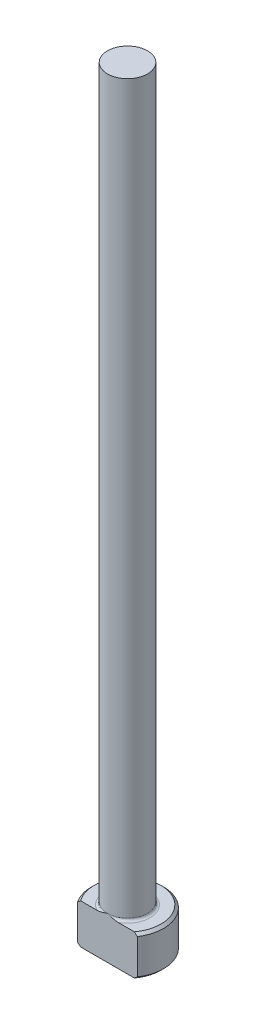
ISO-10303-21;
HEADER;
FILE_DESCRIPTION(('STEP AP214'),'2;1');
FILE_NAME('part.step','',(''),(''),'','','');
FILE_SCHEMA(('AUTOMOTIVE_DESIGN { 1 0 10303 214 1 1 1 1 }'));
ENDSEC;
DATA;
#1=APPLICATION_CONTEXT('core data for automotive mechanical design processes');
#2=APPLICATION_PROTOCOL_DEFINITION('international standard','automotive_design',2000,#1);
#3=PRODUCT_CONTEXT('',#1,'mechanical');
#4=PRODUCT('Part','Part','',(#3));
#5=PRODUCT_RELATED_PRODUCT_CATEGORY('part','',(#4));
#6=PRODUCT_DEFINITION_FORMATION('','',#4);
#7=PRODUCT_DEFINITION_CONTEXT('part definition',#1,'design');
#8=PRODUCT_DEFINITION('design','',#6,#7);
#9=PRODUCT_DEFINITION_SHAPE('','',#8);
#10=(LENGTH_UNIT() NAMED_UNIT(*) SI_UNIT(.MILLI.,.METRE.));
#11=(NAMED_UNIT(*) PLANE_ANGLE_UNIT() SI_UNIT($,.RADIAN.));
#12=(NAMED_UNIT(*) SI_UNIT($,.STERADIAN.) SOLID_ANGLE_UNIT());
#13=UNCERTAINTY_MEASURE_WITH_UNIT(LENGTH_MEASURE(1.E-05),#10,'distance_accuracy_value','');
#14=(GEOMETRIC_REPRESENTATION_CONTEXT(3) GLOBAL_UNCERTAINTY_ASSIGNED_CONTEXT((#13)) GLOBAL_UNIT_ASSIGNED_CONTEXT((#10,
#11,#12)) REPRESENTATION_CONTEXT('',''));
#15=CARTESIAN_POINT('',(0.,0.,0.));
#16=DIRECTION('',(0.,0.,1.));
#17=DIRECTION('',(1.,0.,0.));
#18=AXIS2_PLACEMENT_3D('',#15,#16,#17);
#19=CARTESIAN_POINT('',(0.,0.,0.));
#20=DIRECTION('',(0.,-1.,0.));
#21=DIRECTION('',(0.,0.,-1.));
#22=AXIS2_PLACEMENT_3D('',#19,#20,#21);
#23=PLANE('',#22);
#24=CARTESIAN_POINT('',(0.,0.,0.));
#25=DIRECTION('',(0.,-1.,0.));
#26=DIRECTION('',(0.,0.,-1.));
#27=AXIS2_PLACEMENT_3D('',#24,#25,#26);
#28=CIRCLE('',#27,3.3147);
#29=CARTESIAN_POINT('',(-2.65556240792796,0.,1.98373999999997));
#30=VERTEX_POINT('',#29);
#31=CARTESIAN_POINT('',(2.65556240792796,0.,1.98373999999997));
#32=VERTEX_POINT('',#31);
#33=EDGE_CURVE('E98',#30,#32,#28,.T.);
#34=ORIENTED_EDGE('',*,*,#33,.T.);
#35=DIRECTION('',(-1.,0.,0.));
#36=VECTOR('',#35,1.);
#37=CARTESIAN_POINT('',(-2.96654602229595,0.,1.98373999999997));
#38=LINE('',#37,#36);
#39=EDGE_CURVE('E83',#32,#30,#38,.T.);
#40=ORIENTED_EDGE('',*,*,#39,.T.);
#41=EDGE_LOOP('',(#34,#40));
#42=FACE_BOUND('',#41,.T.);
#43=ADVANCED_FACE('F32',(#42),#23,.T.);
#44=CARTESIAN_POINT('',(0.,259.958771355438,0.));
#45=DIRECTION('',(0.,1.,0.));
#46=DIRECTION('',(0.,0.,1.));
#47=AXIS2_PLACEMENT_3D('',#44,#45,#46);
#48=CYLINDRICAL_SURFACE('',#47,3.56869999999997);
#49=CARTESIAN_POINT('',(0.,3.7084,0.));
#50=DIRECTION('',(0.,1.,0.));
#51=DIRECTION('',(0.,0.,1.));
#52=AXIS2_PLACEMENT_3D('',#49,#50,#51);
#53=CIRCLE('',#52,3.56869999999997);
#54=CARTESIAN_POINT('',(-2.96654602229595,3.7084,1.98373999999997));
#55=VERTEX_POINT('',#54);
#56=CARTESIAN_POINT('',(2.96654602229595,3.7084,1.98373999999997));
#57=VERTEX_POINT('',#56);
#58=EDGE_CURVE('E104',#55,#57,#53,.F.);
#59=ORIENTED_EDGE('',*,*,#58,.T.);
#60=DIRECTION('',(0.,-1.,0.));
#61=VECTOR('',#60,1.);
#62=CARTESIAN_POINT('',(2.96654602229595,76.2,1.98373999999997));
#63=LINE('',#62,#61);
#64=CARTESIAN_POINT('',(2.96654602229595,0.253999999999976,1.98373999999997));
#65=VERTEX_POINT('',#64);
#66=EDGE_CURVE('E183',#57,#65,#63,.T.);
#67=ORIENTED_EDGE('',*,*,#66,.T.);
#68=CARTESIAN_POINT('',(0.,0.253999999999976,0.));
#69=DIRECTION('',(0.,-1.,0.));
#70=DIRECTION('',(0.,0.,-1.));
#71=AXIS2_PLACEMENT_3D('',#68,#69,#70);
#72=CIRCLE('',#71,3.56869999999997);
#73=CARTESIAN_POINT('',(-2.96654602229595,0.253999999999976,1.98373999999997));
#74=VERTEX_POINT('',#73);
#75=EDGE_CURVE('E100',#65,#74,#72,.F.);
#76=ORIENTED_EDGE('',*,*,#75,.T.);
#77=DIRECTION('',(0.,-1.,0.));
#78=VECTOR('',#77,1.);
#79=CARTESIAN_POINT('',(-2.96654602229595,76.2,1.98373999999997));
#80=LINE('',#79,#78);
#81=EDGE_CURVE('E93',#55,#74,#80,.T.);
#82=ORIENTED_EDGE('',*,*,#81,.F.);
#83=EDGE_LOOP('',(#59,#67,#76,#82));
#84=FACE_BOUND('',#83,.T.);
#85=ADVANCED_FACE('F158',(#84),#48,.T.);
#86=CARTESIAN_POINT('',(-3.56869999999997,3.9624,0.));
#87=DIRECTION('',(0.,1.,0.));
#88=DIRECTION('',(0.,0.,1.));
#89=AXIS2_PLACEMENT_3D('',#86,#87,#88);
#90=PLANE('',#89);
#91=CARTESIAN_POINT('',(0.,3.9624,0.));
#92=DIRECTION('',(0.,1.,0.));
#93=DIRECTION('',(0.,0.,1.));
#94=AXIS2_PLACEMENT_3D('',#91,#92,#93);
#95=CIRCLE('',#94,3.31469999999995);
#96=CARTESIAN_POINT('',(2.6555624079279,3.9624,1.98373999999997));
#97=VERTEX_POINT('',#96);
#98=CARTESIAN_POINT('',(-2.6555624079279,3.9624,1.98373999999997));
#99=VERTEX_POINT('',#98);
#100=EDGE_CURVE('E178',#97,#99,#95,.T.);
#101=ORIENTED_EDGE('',*,*,#100,.T.);
#102=DIRECTION('',(1.,0.,0.));
#103=VECTOR('',#102,1.);
#104=CARTESIAN_POINT('',(-3.56869999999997,3.9624,1.98373999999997));
#105=LINE('',#104,#103);
#106=CARTESIAN_POINT('',(-1.03549790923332,3.96240000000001,1.98373999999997));
#107=VERTEX_POINT('',#106);
#108=EDGE_CURVE('E57',#99,#107,#105,.T.);
#109=ORIENTED_EDGE('',*,*,#108,.T.);
#110=CARTESIAN_POINT('',(0.,3.9624,0.));
#111=DIRECTION('',(0.,1.,0.));
#112=DIRECTION('',(0.,0.,1.));
#113=AXIS2_PLACEMENT_3D('',#110,#111,#112);
#114=CIRCLE('',#113,2.23773999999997);
#115=CARTESIAN_POINT('',(1.03549790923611,3.96240000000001,1.98373999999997));
#116=VERTEX_POINT('',#115);
#117=EDGE_CURVE('E107',#107,#116,#114,.F.);
#118=ORIENTED_EDGE('',*,*,#117,.T.);
#119=EDGE_CURVE('E136',#116,#97,#105,.T.);
#120=ORIENTED_EDGE('',*,*,#119,.T.);
#121=EDGE_LOOP('',(#101,#109,#118,#120));
#122=FACE_BOUND('',#121,.T.);
#123=ADVANCED_FACE('F147',(#122),#90,.T.);
#124=CARTESIAN_POINT('',(0.,3.96239999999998,0.));
#125=DIRECTION('',(0.,-1.,0.));
#126=DIRECTION('',(0.,0.,-1.));
#127=AXIS2_PLACEMENT_3D('',#124,#125,#126);
#128=CONICAL_SURFACE('',#127,3.31469999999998,0.78539816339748);
#129=ORIENTED_EDGE('',*,*,#58,.F.);
#130=CARTESIAN_POINT('',(-6.52986193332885,0.452561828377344,1.98373999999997));
#131=CARTESIAN_POINT('',(-6.40873458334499,0.568456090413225,1.98373999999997));
#132=CARTESIAN_POINT('',(-6.28747416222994,0.684211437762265,1.98373999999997));
#133=CARTESIAN_POINT('',(-6.04463163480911,0.915385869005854,1.98373999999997));
#134=CARTESIAN_POINT('',(-5.92304952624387,1.03080495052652,1.98373999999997));
#135=CARTESIAN_POINT('',(-5.55767819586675,1.37652609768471,1.98373999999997));
#136=CARTESIAN_POINT('',(-5.3133253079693,1.60623326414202,1.98373999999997));
#137=CARTESIAN_POINT('',(-4.82149182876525,2.06424424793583,1.98373999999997));
#138=CARTESIAN_POINT('',(-4.57400269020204,2.29253892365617,1.98373999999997));
#139=CARTESIAN_POINT('',(-4.20028152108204,2.63221766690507,1.98373999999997));
#140=CARTESIAN_POINT('',(-4.07530040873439,2.74497702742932,1.98373999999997));
#141=CARTESIAN_POINT('',(-3.82427385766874,2.96930379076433,1.98373999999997));
#142=CARTESIAN_POINT('',(-3.69822843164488,3.08087120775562,1.98373999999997));
#143=CARTESIAN_POINT('',(-3.4400142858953,3.30660356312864,1.98373999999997));
#144=CARTESIAN_POINT('',(-3.30779329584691,3.42070884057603,1.98373999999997));
#145=CARTESIAN_POINT('',(-3.04138139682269,3.64664156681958,1.98373999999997));
#146=CARTESIAN_POINT('',(-2.90719023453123,3.75846871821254,1.98373999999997));
#147=CARTESIAN_POINT('',(-2.6361583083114,3.9788690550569,1.98373999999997));
#148=CARTESIAN_POINT('',(-2.49931761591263,4.08744232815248,1.98373999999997));
#149=CARTESIAN_POINT('',(-2.22197102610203,4.2997921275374,1.98373999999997));
#150=CARTESIAN_POINT('',(-2.08146612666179,4.40356993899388,1.98373999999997));
#151=CARTESIAN_POINT('',(-1.85886698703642,4.55911967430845,1.98373999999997));
#152=CARTESIAN_POINT('',(-1.77859431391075,4.61348917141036,1.98373999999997));
#153=CARTESIAN_POINT('',(-1.61606314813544,4.71915963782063,1.98373999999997));
#154=CARTESIAN_POINT('',(-1.53380502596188,4.77046117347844,1.98373999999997));
#155=CARTESIAN_POINT('',(-1.36686413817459,4.86898764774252,1.98373999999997));
#156=CARTESIAN_POINT('',(-1.28218169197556,4.91621312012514,1.98373999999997));
#157=CARTESIAN_POINT('',(-1.10999775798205,5.00512382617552,1.98373999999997));
#158=CARTESIAN_POINT('',(-1.02249748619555,5.0468114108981,1.98373999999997));
#159=CARTESIAN_POINT('',(-0.81383013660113,5.13563123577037,1.98373999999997));
#160=CARTESIAN_POINT('',(-0.691323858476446,5.17980224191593,1.98373999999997));
#161=CARTESIAN_POINT('',(-0.503703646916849,5.23128984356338,1.98373999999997));
#162=CARTESIAN_POINT('',(-0.440603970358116,5.24598141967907,1.98373999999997));
#163=CARTESIAN_POINT('',(-0.313367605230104,5.26973239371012,1.98373999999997));
#164=CARTESIAN_POINT('',(-0.249231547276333,5.27879509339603,1.98373999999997));
#165=CARTESIAN_POINT('',(-0.119629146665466,5.29081518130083,1.98373999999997));
#166=CARTESIAN_POINT('',(-0.0541560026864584,5.29370053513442,1.98373999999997));
#167=CARTESIAN_POINT('',(0.0767508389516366,5.29295512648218,1.98373999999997));
#168=CARTESIAN_POINT('',(0.142184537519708,5.28932452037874,1.98373999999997));
#169=CARTESIAN_POINT('',(0.27249490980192,5.27578328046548,1.98373999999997));
#170=CARTESIAN_POINT('',(0.337370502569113,5.26586242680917,1.98373999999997));
#171=CARTESIAN_POINT('',(0.465987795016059,5.24034027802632,1.98373999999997));
#172=CARTESIAN_POINT('',(0.529729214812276,5.22473760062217,1.98373999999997));
#173=CARTESIAN_POINT('',(0.683350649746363,5.18075634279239,1.98373999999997));
#174=CARTESIAN_POINT('',(0.772481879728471,5.14977428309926,1.98373999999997));
#175=CARTESIAN_POINT('',(0.947660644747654,5.08010058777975,1.98373999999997));
#176=CARTESIAN_POINT('',(1.03370599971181,5.04140362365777,1.98373999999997));
#177=CARTESIAN_POINT('',(1.20339709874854,4.95807051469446,1.98373999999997));
#178=CARTESIAN_POINT('',(1.28702792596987,4.91340434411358,1.98373999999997));
#179=CARTESIAN_POINT('',(1.41060260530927,4.84319759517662,1.98373999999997));
#180=CARTESIAN_POINT('',(1.45147639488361,4.81926449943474,1.98373999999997));
#181=CARTESIAN_POINT('',(1.53266103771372,4.77046435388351,1.98373999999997));
#182=CARTESIAN_POINT('',(1.57297191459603,4.745597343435,1.98373999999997));
#183=CARTESIAN_POINT('',(1.70662848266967,4.66127979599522,1.98373999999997));
#184=CARTESIAN_POINT('',(1.79884137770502,4.60003201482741,1.98373999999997));
#185=CARTESIAN_POINT('',(1.981065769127,4.47433262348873,1.98373999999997));
#186=CARTESIAN_POINT('',(2.07107672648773,4.40988024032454,1.98373999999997));
#187=CARTESIAN_POINT('',(2.24940000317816,4.27853620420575,1.98373999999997));
#188=CARTESIAN_POINT('',(2.3377109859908,4.21164274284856,1.98373999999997));
#189=CARTESIAN_POINT('',(2.51291571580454,4.07602097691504,1.98373999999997));
#190=CARTESIAN_POINT('',(2.59980937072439,4.00729255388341,1.98373999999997));
#191=CARTESIAN_POINT('',(2.85922047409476,3.79863581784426,1.98373999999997));
#192=CARTESIAN_POINT('',(3.03001914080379,3.65657350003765,1.98373999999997));
#193=CARTESIAN_POINT('',(3.36845974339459,3.368919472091,1.98373999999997));
#194=CARTESIAN_POINT('',(3.5361030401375,3.22332934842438,1.98373999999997));
#195=CARTESIAN_POINT('',(3.86946040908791,2.92948579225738,1.98373999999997));
#196=CARTESIAN_POINT('',(4.03517138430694,2.7812288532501,1.98373999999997));
#197=CARTESIAN_POINT('',(4.36503284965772,2.48295883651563,1.98373999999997));
#198=CARTESIAN_POINT('',(4.52918317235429,2.33294557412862,1.98373999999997));
#199=CARTESIAN_POINT('',(4.85609064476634,2.03183529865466,1.98373999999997));
#200=CARTESIAN_POINT('',(5.01884932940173,1.88073994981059,1.98373999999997));
#201=CARTESIAN_POINT('',(5.34346533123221,1.57758411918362,1.98373999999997));
#202=CARTESIAN_POINT('',(5.50532264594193,1.425523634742,1.98373999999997));
#203=CARTESIAN_POINT('',(5.73906525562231,1.20490693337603,1.98373999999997));
#204=CARTESIAN_POINT('',(5.81123331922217,1.13664991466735,1.98373999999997));
#205=CARTESIAN_POINT('',(5.95545466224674,0.999988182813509,1.98373999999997));
#206=CARTESIAN_POINT('',(6.02750791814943,0.931583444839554,1.98373999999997));
#207=CARTESIAN_POINT('',(6.17134461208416,0.794799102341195,1.98373999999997));
#208=CARTESIAN_POINT('',(6.24312829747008,0.726419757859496,1.98373999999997));
#209=CARTESIAN_POINT('',(6.3865776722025,0.589563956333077,1.98373999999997));
#210=CARTESIAN_POINT('',(6.45824338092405,0.521087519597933,1.98373999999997));
#211=CARTESIAN_POINT('',(6.52986193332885,0.452561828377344,1.98373999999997));
#212=B_SPLINE_CURVE_WITH_KNOTS('',3,(#130,#131,#132,#133,#134,#135,#136,#137,#138,#139,#140,
#141,#142,#143,#144,#145,#146,#147,#148,#149,#150,#151,#152,#153,#154,#155,#156,#157,#158,#159,
#160,#161,#162,#163,#164,#165,#166,#167,#168,#169,#170,#171,#172,#173,#174,#175,#176,#177,#178,
#179,#180,#181,#182,#183,#184,#185,#186,#187,#188,#189,#190,#191,#192,#193,#194,#195,#196,#197,
#198,#199,#200,#201,#202,#203,#204,#205,#206,#207,#208,#209,#210,#211),.UNSPECIFIED.,.F.,.F.,(4,
2,2,2,2,2,2,2,2,2,2,2,2,2,2,2,2,2,2,2,2,2,2,2,2,2,2,2,2,2,2,2,2,2,2,2,2,2,2,2,4),(0.,
0.50292129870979,1.00584613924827,2.01195072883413,3.02203392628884,3.52701801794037,
4.03199609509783,4.55592627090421,5.07992441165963,5.60390842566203,6.12775118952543,
6.41855604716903,6.70930705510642,7.00001993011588,7.29060898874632,7.67991368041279,
7.87406585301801,8.06810403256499,8.26439284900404,8.4606769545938,8.65728078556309,
8.8539324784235,9.13651242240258,9.41928821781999,9.70354407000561,9.84563042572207,
9.98771079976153,10.3197055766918,10.6517808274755,10.9841072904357,11.3164552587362,
11.9828350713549,12.6489205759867,13.3159573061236,13.9830648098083,14.6493042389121,
15.3155455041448,15.6135474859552,15.9116042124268,16.2090224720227,16.5063857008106),.UNSPECIFIED.);
#213=EDGE_CURVE('E135',#55,#99,#212,.T.);
#214=ORIENTED_EDGE('',*,*,#213,.T.);
#215=ORIENTED_EDGE('',*,*,#100,.F.);
#216=EDGE_CURVE('E127',#97,#57,#212,.T.);
#217=ORIENTED_EDGE('',*,*,#216,.T.);
#218=EDGE_LOOP('',(#129,#214,#215,#217));
#219=FACE_BOUND('',#218,.T.);
#220=ADVANCED_FACE('F143',(#219),#128,.T.);
#221=CARTESIAN_POINT('',(0.,0.253999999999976,0.));
#222=DIRECTION('',(0.,1.,0.));
#223=DIRECTION('',(0.,0.,1.));
#224=AXIS2_PLACEMENT_3D('',#221,#222,#223);
#225=CONICAL_SURFACE('',#224,3.56869999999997,0.785398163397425);
#226=ORIENTED_EDGE('',*,*,#75,.F.);
#227=CARTESIAN_POINT('',(6.52986193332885,3.50983817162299,1.98373999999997));
#228=CARTESIAN_POINT('',(6.40873458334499,3.39394390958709,1.98373999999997));
#229=CARTESIAN_POINT('',(6.28747416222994,3.27818856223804,1.98373999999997));
#230=CARTESIAN_POINT('',(6.0446316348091,3.04701413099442,1.98373999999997));
#231=CARTESIAN_POINT('',(5.92304952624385,2.93159504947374,1.98373999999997));
#232=CARTESIAN_POINT('',(5.55767819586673,2.58587390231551,1.98373999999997));
#233=CARTESIAN_POINT('',(5.31332530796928,2.35616673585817,1.98373999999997));
#234=CARTESIAN_POINT('',(4.82149182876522,1.8981557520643,1.98373999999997));
#235=CARTESIAN_POINT('',(4.574002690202,1.66986107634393,1.98373999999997));
#236=CARTESIAN_POINT('',(4.200281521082,1.33018233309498,1.98373999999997));
#237=CARTESIAN_POINT('',(4.07530040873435,1.21742297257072,1.98373999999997));
#238=CARTESIAN_POINT('',(3.82427385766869,0.993096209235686,1.98373999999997));
#239=CARTESIAN_POINT('',(3.69822843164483,0.881528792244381,1.98373999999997));
#240=CARTESIAN_POINT('',(3.44001428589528,0.655796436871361,1.98373999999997));
#241=CARTESIAN_POINT('',(3.30779329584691,0.541691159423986,1.98373999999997));
#242=CARTESIAN_POINT('',(3.04138139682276,0.315758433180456,1.98373999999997));
#243=CARTESIAN_POINT('',(2.90719023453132,0.203931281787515,1.98373999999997));
#244=CARTESIAN_POINT('',(2.63615830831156,-0.0164690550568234,1.98373999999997));
#245=CARTESIAN_POINT('',(2.49931761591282,-0.125042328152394,1.98373999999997));
#246=CARTESIAN_POINT('',(2.22197102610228,-0.337392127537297,1.98373999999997));
#247=CARTESIAN_POINT('',(2.08146612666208,-0.441169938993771,1.98373999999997));
#248=CARTESIAN_POINT('',(1.85886698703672,-0.596719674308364,1.98373999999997));
#249=CARTESIAN_POINT('',(1.77859431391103,-0.651089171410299,1.98373999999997));
#250=CARTESIAN_POINT('',(1.61606314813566,-0.756759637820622,1.98373999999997));
#251=CARTESIAN_POINT('',(1.53380502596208,-0.808061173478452,1.98373999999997));
#252=CARTESIAN_POINT('',(1.36686413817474,-0.90658764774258,1.98373999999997));
#253=CARTESIAN_POINT('',(1.28218169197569,-0.953813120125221,1.98373999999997));
#254=CARTESIAN_POINT('',(1.10999775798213,-1.04272382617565,1.98373999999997));
#255=CARTESIAN_POINT('',(1.0224974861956,-1.08441141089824,1.98373999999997));
#256=CARTESIAN_POINT('',(0.813830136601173,-1.17323123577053,1.98373999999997));
#257=CARTESIAN_POINT('',(0.691323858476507,-1.2174022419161,1.98373999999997));
#258=CARTESIAN_POINT('',(0.503703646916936,-1.26888984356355,1.98373999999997));
#259=CARTESIAN_POINT('',(0.440603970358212,-1.28358141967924,1.98373999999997));
#260=CARTESIAN_POINT('',(0.313367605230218,-1.3073323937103,1.98373999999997));
#261=CARTESIAN_POINT('',(0.249231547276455,-1.31639509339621,1.98373999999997));
#262=CARTESIAN_POINT('',(0.119629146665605,-1.32841518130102,1.98373999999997));
#263=CARTESIAN_POINT('',(0.0541560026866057,-1.33130053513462,1.98373999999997));
#264=CARTESIAN_POINT('',(-0.0767508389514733,-1.33055512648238,1.98373999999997));
#265=CARTESIAN_POINT('',(-0.142184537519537,-1.32692452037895,1.98373999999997));
#266=CARTESIAN_POINT('',(-0.272494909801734,-1.3133832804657,1.98373999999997));
#267=CARTESIAN_POINT('',(-0.337370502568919,-1.30346242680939,1.98373999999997));
#268=CARTESIAN_POINT('',(-0.465987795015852,-1.27794027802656,1.98373999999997));
#269=CARTESIAN_POINT('',(-0.529729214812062,-1.26233760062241,1.98373999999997));
#270=CARTESIAN_POINT('',(-0.683350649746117,-1.21835634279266,1.98373999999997));
#271=CARTESIAN_POINT('',(-0.772481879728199,-1.18737428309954,1.98373999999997));
#272=CARTESIAN_POINT('',(-0.947660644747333,-1.11770058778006,1.98373999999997));
#273=CARTESIAN_POINT('',(-1.03370599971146,-1.0790036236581,1.98373999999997));
#274=CARTESIAN_POINT('',(-1.20339709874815,-0.99567051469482,1.98373999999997));
#275=CARTESIAN_POINT('',(-1.28702792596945,-0.951004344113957,1.98373999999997));
#276=CARTESIAN_POINT('',(-1.41060260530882,-0.88079759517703,1.98373999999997));
#277=CARTESIAN_POINT('',(-1.45147639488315,-0.856864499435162,1.98373999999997));
#278=CARTESIAN_POINT('',(-1.53266103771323,-0.808064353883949,1.98373999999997));
#279=CARTESIAN_POINT('',(-1.57297191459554,-0.783197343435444,1.98373999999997));
#280=CARTESIAN_POINT('',(-1.70662848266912,-0.698879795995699,1.98373999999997));
#281=CARTESIAN_POINT('',(-1.79884137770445,-0.637632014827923,1.98373999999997));
#282=CARTESIAN_POINT('',(-1.98106576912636,-0.511932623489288,1.98373999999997));
#283=CARTESIAN_POINT('',(-2.07107672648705,-0.447480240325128,1.98373999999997));
#284=CARTESIAN_POINT('',(-2.24940000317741,-0.316136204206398,1.98373999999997));
#285=CARTESIAN_POINT('',(-2.33771098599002,-0.249242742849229,1.98373999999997));
#286=CARTESIAN_POINT('',(-2.51291571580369,-0.113620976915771,1.98373999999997));
#287=CARTESIAN_POINT('',(-2.59980937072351,-0.0448925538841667,1.98373999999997));
#288=CARTESIAN_POINT('',(-2.85922047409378,0.163764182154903,1.98373999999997));
#289=CARTESIAN_POINT('',(-3.03001914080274,0.305826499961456,1.98373999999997));
#290=CARTESIAN_POINT('',(-3.36845974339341,0.593480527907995,1.98373999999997));
#291=CARTESIAN_POINT('',(-3.53610304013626,0.739070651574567,1.98373999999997));
#292=CARTESIAN_POINT('',(-3.86946040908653,1.03291420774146,1.98373999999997));
#293=CARTESIAN_POINT('',(-4.03517138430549,1.18117114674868,1.98373999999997));
#294=CARTESIAN_POINT('',(-4.36503284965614,1.47944116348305,1.98373999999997));
#295=CARTESIAN_POINT('',(-4.52918317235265,1.62945442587,1.98373999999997));
#296=CARTESIAN_POINT('',(-4.85609064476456,1.93056470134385,1.98373999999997));
#297=CARTESIAN_POINT('',(-5.01884932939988,2.08166005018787,1.98373999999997));
#298=CARTESIAN_POINT('',(-5.34346533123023,2.38481588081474,1.98373999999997));
#299=CARTESIAN_POINT('',(-5.50532264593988,2.5368763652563,1.98373999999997));
#300=CARTESIAN_POINT('',(-5.73906525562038,2.75749306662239,1.98373999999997));
#301=CARTESIAN_POINT('',(-5.81123331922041,2.82575008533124,1.98373999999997));
#302=CARTESIAN_POINT('',(-5.95545466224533,2.96241181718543,1.98373999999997));
#303=CARTESIAN_POINT('',(-6.02750791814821,3.03081655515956,1.98373999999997));
#304=CARTESIAN_POINT('',(-6.17134461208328,3.16760089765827,1.98373999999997));
#305=CARTESIAN_POINT('',(-6.24312829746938,3.23598024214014,1.98373999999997));
#306=CARTESIAN_POINT('',(-6.38657767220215,3.37283604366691,1.98373999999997));
#307=CARTESIAN_POINT('',(-6.45824338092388,3.44131248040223,1.98373999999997));
#308=CARTESIAN_POINT('',(-6.52986193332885,3.50983817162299,1.98373999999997));
#309=B_SPLINE_CURVE_WITH_KNOTS('',3,(#227,#228,#229,#230,#231,#232,#233,#234,#235,#236,#237,
#238,#239,#240,#241,#242,#243,#244,#245,#246,#247,#248,#249,#250,#251,#252,#253,#254,#255,#256,
#257,#258,#259,#260,#261,#262,#263,#264,#265,#266,#267,#268,#269,#270,#271,#272,#273,#274,#275,
#276,#277,#278,#279,#280,#281,#282,#283,#284,#285,#286,#287,#288,#289,#290,#291,#292,#293,#294,
#295,#296,#297,#298,#299,#300,#301,#302,#303,#304,#305,#306,#307,#308),.UNSPECIFIED.,.F.,.F.,(4,
2,2,2,2,2,2,2,2,2,2,2,2,2,2,2,2,2,2,2,2,2,2,2,2,2,2,2,2,2,2,2,2,2,2,2,2,2,2,2,4),(0.,
0.502921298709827,1.00584613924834,2.01195072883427,3.02203392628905,3.5270180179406,
4.0319960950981,4.55592627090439,5.07992441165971,5.60390842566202,6.12775118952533,
6.41855604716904,6.70930705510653,7.00001993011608,7.29060898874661,7.67991368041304,
7.87406585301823,8.06810403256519,8.26439284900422,8.46067695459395,8.65728078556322,
8.85393247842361,9.1365124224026,9.41928821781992,9.70354407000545,9.84563042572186,
9.98771079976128,10.3197055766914,10.6517808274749,10.984107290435,11.3164552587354,
11.9828350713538,12.6489205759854,13.3159573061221,13.9830648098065,14.64930423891,
15.3155455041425,15.6135474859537,15.911604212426,16.2090224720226,16.5063857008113),.UNSPECIFIED.);
#310=EDGE_CURVE('E86',#65,#32,#309,.T.);
#311=ORIENTED_EDGE('',*,*,#310,.T.);
#312=ORIENTED_EDGE('',*,*,#33,.F.);
#313=EDGE_CURVE('E89',#30,#74,#309,.T.);
#314=ORIENTED_EDGE('',*,*,#313,.T.);
#315=EDGE_LOOP('',(#226,#311,#312,#314));
#316=FACE_BOUND('',#315,.T.);
#317=ADVANCED_FACE('F97',(#316),#225,.T.);
#318=CARTESIAN_POINT('',(0.,4.21640000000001,0.));
#319=DIRECTION('',(0.,1.,0.));
#320=DIRECTION('',(0.,0.,1.));
#321=AXIS2_PLACEMENT_3D('',#318,#319,#320);
#322=TOROIDAL_SURFACE('',#321,2.23773999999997,0.254);
#323=CARTESIAN_POINT('',(0.,4.21640000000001,1.98373999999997));
#324=CARTESIAN_POINT('',(-4.02307017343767E-11,4.21640057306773,1.98373999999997));
#325=CARTESIAN_POINT('',(1.40828581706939E-07,4.21640114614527,1.98373999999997));
#326=CARTESIAN_POINT('',(5.7339269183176E-07,4.21640224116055,1.98373999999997));
#327=CARTESIAN_POINT('',(8.70731400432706E-07,4.21640276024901,1.98373999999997));
#328=CARTESIAN_POINT('',(1.58225797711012E-06,4.21640380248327,1.98373999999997));
#329=CARTESIAN_POINT('',(2.00604119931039E-06,4.21640431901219,1.98373999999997));
#330=CARTESIAN_POINT('',(2.91133999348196E-06,4.21640528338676,1.98373999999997));
#331=CARTESIAN_POINT('',(3.39207133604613E-06,4.21640573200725,1.98373999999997));
#332=CARTESIAN_POINT('',(5.14628594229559E-06,4.21640727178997,1.98373999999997));
#333=CARTESIAN_POINT('',(6.49332487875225E-06,4.21640828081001,1.98373999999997));
#334=CARTESIAN_POINT('',(9.24843947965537E-06,4.21641004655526,1.98373999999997));
#335=CARTESIAN_POINT('',(1.06506929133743E-05,4.21641081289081,1.98373999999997));
#336=CARTESIAN_POINT('',(1.62369385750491E-05,4.21641377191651,1.98373999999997));
#337=CARTESIAN_POINT('',(2.04997858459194E-05,4.2164158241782,1.98373999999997));
#338=CARTESIAN_POINT('',(2.88176617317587E-05,4.21641910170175,1.98373999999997));
#339=CARTESIAN_POINT('',(3.28481085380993E-05,4.21642039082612,1.98373999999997));
#340=CARTESIAN_POINT('',(5.03242637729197E-05,4.21642599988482,1.98373999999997));
#341=CARTESIAN_POINT('',(6.37475444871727E-05,4.21643035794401,1.98373999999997));
#342=CARTESIAN_POINT('',(8.86866389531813E-05,4.21643721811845,1.98373999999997));
#343=CARTESIAN_POINT('',(0.000100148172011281,4.21643990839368,1.98373999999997));
#344=CARTESIAN_POINT('',(0.000184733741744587,4.21646156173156,1.98373999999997));
#345=CARTESIAN_POINT('',(0.0002551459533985,4.21648964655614,1.98373999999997));
#346=CARTESIAN_POINT('',(0.000530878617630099,4.21659565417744,1.98373999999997));
#347=CARTESIAN_POINT('',(0.000738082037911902,4.21666677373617,1.98373999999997));
#348=CARTESIAN_POINT('',(0.00154925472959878,4.21694925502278,1.98373999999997));
#349=CARTESIAN_POINT('',(0.00215130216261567,4.21716774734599,1.98373999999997));
#350=CARTESIAN_POINT('',(0.00462988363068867,4.21806309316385,1.98373999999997));
#351=CARTESIAN_POINT('',(0.00650853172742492,4.21873189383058,1.98373999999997));
#352=CARTESIAN_POINT('',(0.0303581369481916,4.22722764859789,1.98373999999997));
#353=CARTESIAN_POINT('',(0.0523158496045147,4.23510626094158,1.98373999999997));
#354=CARTESIAN_POINT('',(0.0954269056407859,4.25047917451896,1.98373999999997));
#355=CARTESIAN_POINT('',(0.11657919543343,4.25797672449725,1.98373999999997));
#356=CARTESIAN_POINT('',(0.161458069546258,4.27377445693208,1.98373999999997));
#357=CARTESIAN_POINT('',(0.185188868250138,4.28206294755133,1.98373999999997));
#358=CARTESIAN_POINT('',(0.232964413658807,4.29853259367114,1.98373999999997));
#359=CARTESIAN_POINT('',(0.257009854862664,4.30671173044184,1.98373999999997));
#360=CARTESIAN_POINT('',(0.316193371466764,4.32648112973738,1.98373999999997));
#361=CARTESIAN_POINT('',(0.3513814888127,4.33792303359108,1.98373999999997));
#362=CARTESIAN_POINT('',(0.421152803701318,4.35974103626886,1.98373999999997));
#363=CARTESIAN_POINT('',(0.455729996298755,4.37013624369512,1.98373999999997));
#364=CARTESIAN_POINT('',(0.532487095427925,4.39200885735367,1.98373999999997));
#365=CARTESIAN_POINT('',(0.574734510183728,4.4032531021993,1.98373999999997));
#366=CARTESIAN_POINT('',(0.6600384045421,4.42385016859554,1.98373999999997));
#367=CARTESIAN_POINT('',(0.703098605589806,4.43318780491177,1.98373999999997));
#368=CARTESIAN_POINT('',(0.792838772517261,4.44980860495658,1.98373999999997));
#369=CARTESIAN_POINT('',(0.83955648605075,4.45689590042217,1.98373999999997));
#370=CARTESIAN_POINT('',(0.933305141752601,4.46701113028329,1.98373999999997));
#371=CARTESIAN_POINT('',(0.980334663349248,4.47005158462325,1.98373999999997));
#372=CARTESIAN_POINT('',(1.07363680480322,4.47068781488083,1.98373999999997));
#373=CARTESIAN_POINT('',(1.11990681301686,4.46838602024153,1.98373999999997));
#374=CARTESIAN_POINT('',(1.18820667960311,4.45949572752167,1.98373999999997));
#375=CARTESIAN_POINT('',(1.21059706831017,4.45568261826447,1.98373999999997));
#376=CARTESIAN_POINT('',(1.25489724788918,4.44592513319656,1.98373999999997));
#377=CARTESIAN_POINT('',(1.27680769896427,4.43998390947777,1.98373999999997));
#378=CARTESIAN_POINT('',(1.31298334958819,4.42779727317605,1.98373999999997));
#379=CARTESIAN_POINT('',(1.32747926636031,4.42223947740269,1.98373999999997));
#380=CARTESIAN_POINT('',(1.35590450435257,4.40970381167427,1.98373999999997));
#381=CARTESIAN_POINT('',(1.36983212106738,4.40272199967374,1.98373999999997));
#382=CARTESIAN_POINT('',(1.39685784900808,4.38707849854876,1.98373999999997));
#383=CARTESIAN_POINT('',(1.40994935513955,4.37840521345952,1.98373999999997));
#384=CARTESIAN_POINT('',(1.43467906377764,4.35918713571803,1.98373999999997));
#385=CARTESIAN_POINT('',(1.44632058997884,4.34864676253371,1.98373999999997));
#386=CARTESIAN_POINT('',(1.46405523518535,4.32920735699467,1.98373999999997));
#387=CARTESIAN_POINT('',(1.47073699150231,4.32084820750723,1.98373999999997));
#388=CARTESIAN_POINT('',(1.48274781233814,4.30319678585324,1.98373999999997));
#389=CARTESIAN_POINT('',(1.48807744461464,4.29390490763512,1.98373999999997));
#390=CARTESIAN_POINT('',(1.49706189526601,4.27440249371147,1.98373999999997));
#391=CARTESIAN_POINT('',(1.50069745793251,4.2641829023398,1.98373999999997));
#392=CARTESIAN_POINT('',(1.50584635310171,4.24322268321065,1.98373999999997));
#393=CARTESIAN_POINT('',(1.50736266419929,4.23248280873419,1.98373999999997));
#394=CARTESIAN_POINT('',(1.50805409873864,4.21251978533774,1.98373999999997));
#395=CARTESIAN_POINT('',(1.50754134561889,4.2033063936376,1.98373999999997));
#396=CARTESIAN_POINT('',(1.50490308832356,4.18511471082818,1.98373999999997));
#397=CARTESIAN_POINT('',(1.50277735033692,4.17613645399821,1.98373999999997));
#398=CARTESIAN_POINT('',(1.49719456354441,4.15900798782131,1.98373999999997));
#399=CARTESIAN_POINT('',(1.49379391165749,4.15083904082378,1.98373999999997));
#400=CARTESIAN_POINT('',(1.48586548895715,4.13507450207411,1.98373999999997));
#401=CARTESIAN_POINT('',(1.48133740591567,4.12747906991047,1.98373999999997));
#402=CARTESIAN_POINT('',(1.46862962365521,4.10893969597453,1.98373999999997));
#403=CARTESIAN_POINT('',(1.45980714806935,4.09843603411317,1.98373999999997));
#404=CARTESIAN_POINT('',(1.44060965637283,4.07895123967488,1.98373999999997));
#405=CARTESIAN_POINT('',(1.43023007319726,4.0699747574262,1.98373999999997));
#406=CARTESIAN_POINT('',(1.40223517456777,4.04875837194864,1.98373999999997));
#407=CARTESIAN_POINT('',(1.38384742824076,4.03754372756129,1.98373999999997));
#408=CARTESIAN_POINT('',(1.34565665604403,4.0180221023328,1.98373999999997));
#409=CARTESIAN_POINT('',(1.32585336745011,4.00971566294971,1.98373999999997));
#410=CARTESIAN_POINT('',(1.26986203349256,3.98996652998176,1.98373999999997));
#411=CARTESIAN_POINT('',(1.23279835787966,3.98103330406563,1.98373999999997));
#412=CARTESIAN_POINT('',(1.15741515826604,3.96843140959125,1.98373999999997));
#413=CARTESIAN_POINT('',(1.1190855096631,3.96483389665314,1.98373999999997));
#414=CARTESIAN_POINT('',(1.040510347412,3.96167833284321,1.98373999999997));
#415=CARTESIAN_POINT('',(1.00025822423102,3.96231482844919,1.98373999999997));
#416=CARTESIAN_POINT('',(0.919878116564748,3.96702722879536,1.98373999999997));
#417=CARTESIAN_POINT('',(0.879750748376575,3.97111229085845,1.98373999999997));
#418=CARTESIAN_POINT('',(0.802049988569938,3.98166551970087,1.98373999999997));
#419=CARTESIAN_POINT('',(0.764456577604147,3.98799169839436,1.98373999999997));
#420=CARTESIAN_POINT('',(0.689886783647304,4.00249311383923,1.98373999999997));
#421=CARTESIAN_POINT('',(0.652907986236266,4.0106561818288,1.98373999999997));
#422=CARTESIAN_POINT('',(0.571827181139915,4.03026785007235,1.98373999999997));
#423=CARTESIAN_POINT('',(0.527806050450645,4.04204700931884,1.98373999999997));
#424=CARTESIAN_POINT('',(0.439166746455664,4.06747597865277,1.98373999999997));
#425=CARTESIAN_POINT('',(0.394559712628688,4.08116399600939,1.98373999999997));
#426=CARTESIAN_POINT('',(0.319865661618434,4.10513097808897,1.98373999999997));
#427=CARTESIAN_POINT('',(0.28968006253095,4.11510679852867,1.98373999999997));
#428=CARTESIAN_POINT('',(0.229752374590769,4.1353375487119,1.98373999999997));
#429=CARTESIAN_POINT('',(0.200008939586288,4.14558849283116,1.98373999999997));
#430=CARTESIAN_POINT('',(0.143797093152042,4.16520591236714,1.98373999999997));
#431=CARTESIAN_POINT('',(0.117320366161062,4.17454899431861,1.98373999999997));
#432=CARTESIAN_POINT('',(0.0633624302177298,4.19374573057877,1.98373999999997));
#433=CARTESIAN_POINT('',(0.0358830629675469,4.20360493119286,1.98373999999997));
#434=CARTESIAN_POINT('',(0.00650762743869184,4.21406838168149,1.98373999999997));
#435=CARTESIAN_POINT('',(0.00462809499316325,4.21473753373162,1.98373999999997));
#436=CARTESIAN_POINT('',(0.00214930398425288,4.21563296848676,1.98373999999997));
#437=CARTESIAN_POINT('',(0.00154793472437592,4.21585121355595,1.98373999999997));
#438=CARTESIAN_POINT('',(0.000737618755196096,4.21613339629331,1.98373999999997));
#439=CARTESIAN_POINT('',(0.000530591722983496,4.21620445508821,1.98373999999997));
#440=CARTESIAN_POINT('',(0.000255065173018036,4.21631038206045,1.98373999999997));
#441=CARTESIAN_POINT('',(0.000184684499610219,4.21633845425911,1.98373999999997));
#442=CARTESIAN_POINT('',(0.000100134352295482,4.21636010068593,1.98373999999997));
#443=CARTESIAN_POINT('',(8.86750306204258E-05,4.21636279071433,1.98373999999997));
#444=CARTESIAN_POINT('',(6.37408791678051E-05,4.2163696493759,1.98373999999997));
#445=CARTESIAN_POINT('',(5.03202712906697E-05,4.21637400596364,1.98373999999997));
#446=CARTESIAN_POINT('',(3.2847107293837E-05,4.21637961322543,1.98373999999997));
#447=CARTESIAN_POINT('',(2.88169884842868E-05,4.21638090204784,1.98373999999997));
#448=CARTESIAN_POINT('',(2.04997436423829E-05,4.21638417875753,1.98373999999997));
#449=CARTESIAN_POINT('',(1.62371861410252E-05,4.21638623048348,1.98373999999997));
#450=CARTESIAN_POINT('',(1.06512202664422E-05,4.21638918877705,1.98373999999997));
#451=CARTESIAN_POINT('',(9.24899206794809E-06,4.21638995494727,1.98373999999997));
#452=CARTESIAN_POINT('',(6.49389610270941E-06,4.21639172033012,1.98373999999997));
#453=CARTESIAN_POINT('',(5.14684846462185E-06,4.21639272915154,1.98373999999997));
#454=CARTESIAN_POINT('',(3.39258419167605E-06,4.21639426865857,1.98373999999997));
#455=CARTESIAN_POINT('',(2.91183082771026E-06,4.21639471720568,1.98373999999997));
#456=CARTESIAN_POINT('',(2.00647479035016E-06,4.21639568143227,1.98373999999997));
#457=CARTESIAN_POINT('',(1.5826561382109E-06,4.21639619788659,1.98373999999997));
#458=CARTESIAN_POINT('',(8.71044273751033E-07,4.21639723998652,1.98373999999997));
#459=CARTESIAN_POINT('',(5.73657832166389E-07,4.21639775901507,1.98373999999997));
#460=CARTESIAN_POINT('',(1.40976930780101E-07,4.21639885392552,1.98373999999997));
#461=CARTESIAN_POINT('',(4.02289072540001E-11,4.21639942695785,1.98373999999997));
#462=CARTESIAN_POINT('',(0.,4.21640000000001,1.98373999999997));
#463=B_SPLINE_CURVE_WITH_KNOTS('',3,(#323,#324,#325,#326,#327,#328,#329,#330,#331,#332,#333,
#334,#335,#336,#337,#338,#339,#340,#341,#342,#343,#344,#345,#346,#347,#348,#349,#350,#351,#352,
#353,#354,#355,#356,#357,#358,#359,#360,#361,#362,#363,#364,#365,#366,#367,#368,#369,#370,#371,
#372,#373,#374,#375,#376,#377,#378,#379,#380,#381,#382,#383,#384,#385,#386,#387,#388,#389,#390,
#391,#392,#393,#394,#395,#396,#397,#398,#399,#400,#401,#402,#403,#404,#405,#406,#407,#408,#409,
#410,#411,#412,#413,#414,#415,#416,#417,#418,#419,#420,#421,#422,#423,#424,#425,#426,#427,#428,
#429,#430,#431,#432,#433,#434,#435,#436,#437,#438,#439,#440,#441,#442,#443,#444,#445,#446,#447,
#448,#449,#450,#451,#452,#453,#454,#455,#456,#457,#458,#459,#460,#461,#462),.UNSPECIFIED.,.T.,
.F.,(4,2,2,2,2,2,2,2,2,2,2,2,2,2,2,2,2,2,2,2,2,2,2,2,2,2,2,2,2,2,2,2,2,2,2,2,2,2,2,2,2,2,2,2,2,
2,2,2,2,2,2,2,2,2,2,2,2,2,2,2,2,2,2,2,2,2,2,2,2,4),(0.,1.71984197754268E-06,3.5064557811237E-06,
5.50188707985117E-06,7.47248185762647E-06,1.24982124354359E-05,1.7288326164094E-05,
3.14431062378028E-05,4.41239559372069E-05,8.64578801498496E-05,0.000121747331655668,
0.000348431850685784,0.00100625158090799,0.00292688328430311,0.00891015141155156,
0.0788889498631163,0.146215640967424,0.221624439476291,0.297819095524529,0.408816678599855,
0.517124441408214,0.64824249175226,0.780367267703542,0.921987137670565,1.06316784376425,
1.20166404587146,1.26972615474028,1.33768786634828,1.38420339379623,1.4308494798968,
1.47782736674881,1.5246955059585,1.55669718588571,1.58868540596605,1.62102884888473,
1.65332678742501,1.68086440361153,1.70840601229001,1.73485066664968,1.76130265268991,
1.80222010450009,1.84326000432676,1.90750875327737,1.97176945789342,2.08550754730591,
2.2007491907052,2.32132144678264,2.4422148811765,2.55652068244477,2.67009044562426,
2.80675839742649,2.946716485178,3.04208779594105,3.13646648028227,3.2206986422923,
3.30827404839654,3.31426016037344,3.31617862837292,3.31683588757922,3.31706247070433,
3.31709775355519,3.31714007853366,3.31715275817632,3.31716691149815,3.31717170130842,
3.31717672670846,3.31717869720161,3.31718069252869,3.31718247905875,3.31718419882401),.UNSPECIFIED.);
#464=CARTESIAN_POINT('',(0.,4.21640000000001,1.98373999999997));
#465=VERTEX_POINT('',#464);
#466=EDGE_CURVE('E11',#116,#465,#463,.T.);
#467=ORIENTED_EDGE('',*,*,#466,.F.);
#468=ORIENTED_EDGE('',*,*,#117,.F.);
#469=CARTESIAN_POINT('',(0.,4.21640000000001,1.98373999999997));
#470=CARTESIAN_POINT('',(4.02307140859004E-11,4.21639942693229,1.98373999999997));
#471=CARTESIAN_POINT('',(-1.40828581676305E-07,4.21639885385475,1.98373999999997));
#472=CARTESIAN_POINT('',(-5.73392691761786E-07,4.21639775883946,1.98373999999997));
#473=CARTESIAN_POINT('',(-8.70731400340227E-07,4.21639723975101,1.98373999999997));
#474=CARTESIAN_POINT('',(-1.58225797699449E-06,4.21639619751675,1.98373999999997));
#475=CARTESIAN_POINT('',(-2.00604119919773E-06,4.21639568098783,1.98373999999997));
#476=CARTESIAN_POINT('',(-2.91133999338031E-06,4.21639471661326,1.98373999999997));
#477=CARTESIAN_POINT('',(-3.39207133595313E-06,4.21639426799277,1.98373999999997));
#478=CARTESIAN_POINT('',(-5.14628594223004E-06,4.21639272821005,1.98373999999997));
#479=CARTESIAN_POINT('',(-6.49332487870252E-06,4.21639171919,1.98373999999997));
#480=CARTESIAN_POINT('',(-9.24843947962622E-06,4.21638995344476,1.98373999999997));
#481=CARTESIAN_POINT('',(-1.06506929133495E-05,4.21638918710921,1.98373999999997));
#482=CARTESIAN_POINT('',(-1.62369385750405E-05,4.21638622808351,1.98373999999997));
#483=CARTESIAN_POINT('',(-2.04997858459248E-05,4.21638417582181,1.98373999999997));
#484=CARTESIAN_POINT('',(-2.88176617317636E-05,4.21638089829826,1.98373999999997));
#485=CARTESIAN_POINT('',(-3.28481085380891E-05,4.2163796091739,1.98373999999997));
#486=CARTESIAN_POINT('',(-5.03242637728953E-05,4.2163740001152,1.98373999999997));
#487=CARTESIAN_POINT('',(-6.37475444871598E-05,4.216369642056,1.98373999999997));
#488=CARTESIAN_POINT('',(-8.86866389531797E-05,4.21636278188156,1.98373999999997));
#489=CARTESIAN_POINT('',(-0.00010014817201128,4.21636009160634,1.98373999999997));
#490=CARTESIAN_POINT('',(-0.000184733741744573,4.21633843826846,1.98373999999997));
#491=CARTESIAN_POINT('',(-0.000255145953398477,4.21631035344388,1.98373999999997));
#492=CARTESIAN_POINT('',(-0.000530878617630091,4.21620434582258,1.98373999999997));
#493=CARTESIAN_POINT('',(-0.000738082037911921,4.21613322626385,1.98373999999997));
#494=CARTESIAN_POINT('',(-0.00154925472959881,4.21585074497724,1.98373999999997));
#495=CARTESIAN_POINT('',(-0.00215130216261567,4.21563225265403,1.98373999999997));
#496=CARTESIAN_POINT('',(-0.00462988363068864,4.21473690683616,1.98373999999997));
#497=CARTESIAN_POINT('',(-0.0065085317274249,4.21406810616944,1.98373999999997));
#498=CARTESIAN_POINT('',(-0.0303581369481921,4.20557235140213,1.98373999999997));
#499=CARTESIAN_POINT('',(-0.0523158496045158,4.19769373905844,1.98373999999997));
#500=CARTESIAN_POINT('',(-0.0954269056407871,4.18232082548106,1.98373999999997));
#501=CARTESIAN_POINT('',(-0.116579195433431,4.17482327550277,1.98373999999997));
#502=CARTESIAN_POINT('',(-0.161458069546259,4.15902554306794,1.98373999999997));
#503=CARTESIAN_POINT('',(-0.185188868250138,4.15073705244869,1.98373999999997));
#504=CARTESIAN_POINT('',(-0.232964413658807,4.13426740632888,1.98373999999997));
#505=CARTESIAN_POINT('',(-0.257009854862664,4.12608826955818,1.98373999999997));
#506=CARTESIAN_POINT('',(-0.316193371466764,4.10631887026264,1.98373999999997));
#507=CARTESIAN_POINT('',(-0.3513814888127,4.09487696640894,1.98373999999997));
#508=CARTESIAN_POINT('',(-0.421152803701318,4.07305896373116,1.98373999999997));
#509=CARTESIAN_POINT('',(-0.455729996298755,4.06266375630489,1.98373999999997));
#510=CARTESIAN_POINT('',(-0.532487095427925,4.04079114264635,1.98373999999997));
#511=CARTESIAN_POINT('',(-0.574734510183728,4.02954689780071,1.98373999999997));
#512=CARTESIAN_POINT('',(-0.660038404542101,4.00894983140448,1.98373999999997));
#513=CARTESIAN_POINT('',(-0.703098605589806,3.99961219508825,1.98373999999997));
#514=CARTESIAN_POINT('',(-0.792838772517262,3.98299139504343,1.98373999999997));
#515=CARTESIAN_POINT('',(-0.83955648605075,3.97590409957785,1.98373999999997));
#516=CARTESIAN_POINT('',(-0.933305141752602,3.96578886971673,1.98373999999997));
#517=CARTESIAN_POINT('',(-0.980334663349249,3.96274841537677,1.98373999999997));
#518=CARTESIAN_POINT('',(-1.07363680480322,3.96211218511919,1.98373999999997));
#519=CARTESIAN_POINT('',(-1.11990681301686,3.96441397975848,1.98373999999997));
#520=CARTESIAN_POINT('',(-1.18820667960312,3.97330427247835,1.98373999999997));
#521=CARTESIAN_POINT('',(-1.21059706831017,3.97711738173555,1.98373999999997));
#522=CARTESIAN_POINT('',(-1.25489724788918,3.98687486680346,1.98373999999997));
#523=CARTESIAN_POINT('',(-1.27680769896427,3.99281609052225,1.98373999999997));
#524=CARTESIAN_POINT('',(-1.31298334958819,4.00500272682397,1.98373999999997));
#525=CARTESIAN_POINT('',(-1.32747926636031,4.01056052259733,1.98373999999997));
#526=CARTESIAN_POINT('',(-1.35590450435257,4.02309618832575,1.98373999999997));
#527=CARTESIAN_POINT('',(-1.36983212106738,4.03007800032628,1.98373999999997));
#528=CARTESIAN_POINT('',(-1.39685784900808,4.04572150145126,1.98373999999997));
#529=CARTESIAN_POINT('',(-1.40994935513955,4.05439478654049,1.98373999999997));
#530=CARTESIAN_POINT('',(-1.43467906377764,4.07361286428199,1.98373999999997));
#531=CARTESIAN_POINT('',(-1.44632058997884,4.08415323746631,1.98373999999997));
#532=CARTESIAN_POINT('',(-1.46405523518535,4.10359264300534,1.98373999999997));
#533=CARTESIAN_POINT('',(-1.47073699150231,4.11195179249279,1.98373999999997));
#534=CARTESIAN_POINT('',(-1.48274781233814,4.12960321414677,1.98373999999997));
#535=CARTESIAN_POINT('',(-1.48807744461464,4.1388950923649,1.98373999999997));
#536=CARTESIAN_POINT('',(-1.49706189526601,4.15839750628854,1.98373999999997));
#537=CARTESIAN_POINT('',(-1.50069745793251,4.16861709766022,1.98373999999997));
#538=CARTESIAN_POINT('',(-1.50584635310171,4.18957731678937,1.98373999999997));
#539=CARTESIAN_POINT('',(-1.50736266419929,4.20031719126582,1.98373999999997));
#540=CARTESIAN_POINT('',(-1.50805409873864,4.22028021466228,1.98373999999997));
#541=CARTESIAN_POINT('',(-1.50754134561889,4.22949360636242,1.98373999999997));
#542=CARTESIAN_POINT('',(-1.50490308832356,4.24768528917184,1.98373999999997));
#543=CARTESIAN_POINT('',(-1.50277735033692,4.25666354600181,1.98373999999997));
#544=CARTESIAN_POINT('',(-1.49719456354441,4.27379201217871,1.98373999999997));
#545=CARTESIAN_POINT('',(-1.49379391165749,4.28196095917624,1.98373999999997));
#546=CARTESIAN_POINT('',(-1.48586548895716,4.2977254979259,1.98373999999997));
#547=CARTESIAN_POINT('',(-1.48133740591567,4.30532093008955,1.98373999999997));
#548=CARTESIAN_POINT('',(-1.46862962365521,4.32386030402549,1.98373999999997));
#549=CARTESIAN_POINT('',(-1.45980714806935,4.33436396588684,1.98373999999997));
#550=CARTESIAN_POINT('',(-1.44060965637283,4.35384876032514,1.98373999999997));
#551=CARTESIAN_POINT('',(-1.43023007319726,4.36282524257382,1.98373999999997));
#552=CARTESIAN_POINT('',(-1.40223517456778,4.38404162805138,1.98373999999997));
#553=CARTESIAN_POINT('',(-1.38384742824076,4.39525627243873,1.98373999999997));
#554=CARTESIAN_POINT('',(-1.34565665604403,4.41477789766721,1.98373999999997));
#555=CARTESIAN_POINT('',(-1.32585336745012,4.4230843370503,1.98373999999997));
#556=CARTESIAN_POINT('',(-1.26986203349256,4.44283347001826,1.98373999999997));
#557=CARTESIAN_POINT('',(-1.23279835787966,4.45176669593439,1.98373999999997));
#558=CARTESIAN_POINT('',(-1.15741515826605,4.46436859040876,1.98373999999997));
#559=CARTESIAN_POINT('',(-1.1190855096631,4.46796610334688,1.98373999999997));
#560=CARTESIAN_POINT('',(-1.04051034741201,4.4711216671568,1.98373999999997));
#561=CARTESIAN_POINT('',(-1.00025822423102,4.47048517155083,1.98373999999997));
#562=CARTESIAN_POINT('',(-0.919878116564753,4.46577277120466,1.98373999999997));
#563=CARTESIAN_POINT('',(-0.879750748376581,4.46168770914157,1.98373999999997));
#564=CARTESIAN_POINT('',(-0.802049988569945,4.45113448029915,1.98373999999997));
#565=CARTESIAN_POINT('',(-0.764456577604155,4.44480830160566,1.98373999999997));
#566=CARTESIAN_POINT('',(-0.689886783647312,4.43030688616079,1.98373999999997));
#567=CARTESIAN_POINT('',(-0.652907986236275,4.42214381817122,1.98373999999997));
#568=CARTESIAN_POINT('',(-0.571827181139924,4.40253214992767,1.98373999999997));
#569=CARTESIAN_POINT('',(-0.527806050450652,4.39075299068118,1.98373999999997));
#570=CARTESIAN_POINT('',(-0.43916674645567,4.36532402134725,1.98373999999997));
#571=CARTESIAN_POINT('',(-0.394559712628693,4.35163600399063,1.98373999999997));
#572=CARTESIAN_POINT('',(-0.319865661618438,4.32766902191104,1.98373999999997));
#573=CARTESIAN_POINT('',(-0.289680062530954,4.31769320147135,1.98373999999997));
#574=CARTESIAN_POINT('',(-0.229752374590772,4.29746245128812,1.98373999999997));
#575=CARTESIAN_POINT('',(-0.20000893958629,4.28721150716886,1.98373999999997));
#576=CARTESIAN_POINT('',(-0.143797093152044,4.26759408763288,1.98373999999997));
#577=CARTESIAN_POINT('',(-0.117320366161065,4.2582510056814,1.98373999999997));
#578=CARTESIAN_POINT('',(-0.06336243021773,4.23905426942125,1.98373999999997));
#579=CARTESIAN_POINT('',(-0.0358830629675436,4.22919506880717,1.98373999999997));
#580=CARTESIAN_POINT('',(-0.00650762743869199,4.21873161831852,1.98373999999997));
#581=CARTESIAN_POINT('',(-0.00462809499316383,4.2180624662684,1.98373999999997));
#582=CARTESIAN_POINT('',(-0.00214930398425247,4.21716703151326,1.98373999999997));
#583=CARTESIAN_POINT('',(-0.00154793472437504,4.21694878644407,1.98373999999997));
#584=CARTESIAN_POINT('',(-0.000737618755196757,4.21666660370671,1.98373999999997));
#585=CARTESIAN_POINT('',(-0.00053059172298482,4.2165955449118,1.98373999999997));
#586=CARTESIAN_POINT('',(-0.000255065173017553,4.21648961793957,1.98373999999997));
#587=CARTESIAN_POINT('',(-0.000184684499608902,4.21646154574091,1.98373999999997));
#588=CARTESIAN_POINT('',(-0.000100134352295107,4.21643989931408,1.98373999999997));
#589=CARTESIAN_POINT('',(-8.86750306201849E-05,4.21643720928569,1.98373999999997));
#590=CARTESIAN_POINT('',(-6.37408791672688E-05,4.21643035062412,1.98373999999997));
#591=CARTESIAN_POINT('',(-5.03202712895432E-05,4.21642599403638,1.98373999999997));
#592=CARTESIAN_POINT('',(-3.28471072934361E-05,4.21642038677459,1.98373999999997));
#593=CARTESIAN_POINT('',(-2.88169884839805E-05,4.21641909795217,1.98373999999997));
#594=CARTESIAN_POINT('',(-2.04997436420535E-05,4.21641582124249,1.98373999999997));
#595=CARTESIAN_POINT('',(-1.62371861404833E-05,4.21641376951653,1.98373999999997));
#596=CARTESIAN_POINT('',(-1.06512202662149E-05,4.21641081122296,1.98373999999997));
#597=CARTESIAN_POINT('',(-9.24899206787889E-06,4.21641004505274,1.98373999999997));
#598=CARTESIAN_POINT('',(-6.49389610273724E-06,4.2164082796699,1.98373999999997));
#599=CARTESIAN_POINT('',(-5.14684846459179E-06,4.21640727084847,1.98373999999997));
#600=CARTESIAN_POINT('',(-3.39258419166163E-06,4.21640573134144,1.98373999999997));
#601=CARTESIAN_POINT('',(-2.91183082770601E-06,4.21640528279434,1.98373999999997));
#602=CARTESIAN_POINT('',(-2.00647479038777E-06,4.21640431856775,1.98373999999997));
#603=CARTESIAN_POINT('',(-1.58265613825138E-06,4.21640380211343,1.98373999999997));
#604=CARTESIAN_POINT('',(-8.71044273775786E-07,4.2164027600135,1.98373999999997));
#605=CARTESIAN_POINT('',(-5.73657832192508E-07,4.21640224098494,1.98373999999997));
#606=CARTESIAN_POINT('',(-1.40976930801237E-07,4.2164011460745,1.98373999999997));
#607=CARTESIAN_POINT('',(-4.02289196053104E-11,4.21640057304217,1.98373999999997));
#608=CARTESIAN_POINT('',(0.,4.21640000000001,1.98373999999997));
#609=B_SPLINE_CURVE_WITH_KNOTS('',3,(#469,#470,#471,#472,#473,#474,#475,#476,#477,#478,#479,
#480,#481,#482,#483,#484,#485,#486,#487,#488,#489,#490,#491,#492,#493,#494,#495,#496,#497,#498,
#499,#500,#501,#502,#503,#504,#505,#506,#507,#508,#509,#510,#511,#512,#513,#514,#515,#516,#517,
#518,#519,#520,#521,#522,#523,#524,#525,#526,#527,#528,#529,#530,#531,#532,#533,#534,#535,#536,
#537,#538,#539,#540,#541,#542,#543,#544,#545,#546,#547,#548,#549,#550,#551,#552,#553,#554,#555,
#556,#557,#558,#559,#560,#561,#562,#563,#564,#565,#566,#567,#568,#569,#570,#571,#572,#573,#574,
#575,#576,#577,#578,#579,#580,#581,#582,#583,#584,#585,#586,#587,#588,#589,#590,#591,#592,#593,
#594,#595,#596,#597,#598,#599,#600,#601,#602,#603,#604,#605,#606,#607,#608),.UNSPECIFIED.,.T.,
.F.,(4,2,2,2,2,2,2,2,2,2,2,2,2,2,2,2,2,2,2,2,2,2,2,2,2,2,2,2,2,2,2,2,2,2,2,2,2,2,2,2,2,2,2,2,2,
2,2,2,2,2,2,2,2,2,2,2,2,2,2,2,2,2,2,2,2,2,2,2,2,4),(0.,1.71984197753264E-06,
3.50645578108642E-06,5.50188707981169E-06,7.47248185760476E-06,1.24982124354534E-05,
1.7288326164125E-05,3.14431062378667E-05,4.41239559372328E-05,8.64578801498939E-05,
0.000121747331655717,0.000348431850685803,0.00100625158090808,0.00292688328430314,
0.00891015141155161,0.0788889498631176,0.146215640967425,0.221624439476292,0.297819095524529,
0.408816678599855,0.517124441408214,0.64824249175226,0.780367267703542,0.921987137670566,
1.06316784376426,1.20166404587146,1.26972615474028,1.33768786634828,1.38420339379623,
1.4308494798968,1.47782736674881,1.5246955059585,1.55669718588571,1.58868540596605,
1.62102884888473,1.65332678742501,1.68086440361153,1.70840601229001,1.73485066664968,
1.76130265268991,1.80222010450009,1.84326000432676,1.90750875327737,1.97176945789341,
2.08550754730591,2.2007491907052,2.32132144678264,2.44221488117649,2.55652068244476,
2.67009044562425,2.80675839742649,2.946716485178,3.04208779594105,3.13646648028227,
3.22069864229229,3.30827404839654,3.31426016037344,3.31617862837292,3.31683588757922,
3.31706247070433,3.31709775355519,3.31714007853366,3.31715275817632,3.31716691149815,
3.31717170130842,3.31717672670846,3.31717869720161,3.31718069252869,3.31718247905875,
3.31718419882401),.UNSPECIFIED.);
#610=EDGE_CURVE('E46',#465,#107,#609,.T.);
#611=ORIENTED_EDGE('',*,*,#610,.F.);
#612=CARTESIAN_POINT('',(0.,4.21640000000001,0.));
#613=DIRECTION('',(0.,1.,0.));
#614=DIRECTION('',(0.,0.,1.));
#615=AXIS2_PLACEMENT_3D('',#612,#613,#614);
#616=CIRCLE('',#615,1.98373999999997);
#617=EDGE_CURVE('E103',#465,#465,#616,.T.);
#618=ORIENTED_EDGE('',*,*,#617,.F.);
#619=EDGE_LOOP('',(#467,#468,#611,#618));
#620=FACE_BOUND('',#619,.T.);
#621=ADVANCED_FACE('F34',(#620),#322,.F.);
#622=CARTESIAN_POINT('',(0.,259.958771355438,0.));
#623=DIRECTION('',(0.,1.,0.));
#624=DIRECTION('',(0.,0.,1.));
#625=AXIS2_PLACEMENT_3D('',#622,#623,#624);
#626=CYLINDRICAL_SURFACE('',#625,1.98373999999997);
#627=ORIENTED_EDGE('',*,*,#617,.T.);
#628=EDGE_LOOP('',(#627));
#629=FACE_BOUND('',#628,.T.);
#630=CARTESIAN_POINT('',(0.,76.2,0.));
#631=DIRECTION('',(0.,1.,0.));
#632=DIRECTION('',(0.,0.,1.));
#633=AXIS2_PLACEMENT_3D('',#630,#631,#632);
#634=CIRCLE('',#633,1.98373999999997);
#635=CARTESIAN_POINT('',(0.,76.2,1.98373999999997));
#636=VERTEX_POINT('',#635);
#637=EDGE_CURVE('E101',#636,#636,#634,.T.);
#638=ORIENTED_EDGE('',*,*,#637,.F.);
#639=EDGE_LOOP('',(#638));
#640=FACE_BOUND('',#639,.T.);
#641=ADVANCED_FACE('F155',(#629,#640),#626,.T.);
#642=CARTESIAN_POINT('',(-1.98373999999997,76.2,0.));
#643=DIRECTION('',(0.,1.,0.));
#644=DIRECTION('',(0.,0.,1.));
#645=AXIS2_PLACEMENT_3D('',#642,#643,#644);
#646=PLANE('',#645);
#647=ORIENTED_EDGE('',*,*,#637,.T.);
#648=EDGE_LOOP('',(#647));
#649=FACE_BOUND('',#648,.T.);
#650=ADVANCED_FACE('F121',(#649),#646,.T.);
#651=CARTESIAN_POINT('',(-2.96654602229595,76.2,1.98373999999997));
#652=DIRECTION('',(0.,0.,1.));
#653=DIRECTION('',(1.,0.,0.));
#654=AXIS2_PLACEMENT_3D('',#651,#652,#653);
#655=PLANE('',#654);
#656=ORIENTED_EDGE('',*,*,#66,.F.);
#657=ORIENTED_EDGE('',*,*,#216,.F.);
#658=ORIENTED_EDGE('',*,*,#119,.F.);
#659=ORIENTED_EDGE('',*,*,#466,.T.);
#660=ORIENTED_EDGE('',*,*,#610,.T.);
#661=ORIENTED_EDGE('',*,*,#108,.F.);
#662=ORIENTED_EDGE('',*,*,#213,.F.);
#663=ORIENTED_EDGE('',*,*,#81,.T.);
#664=ORIENTED_EDGE('',*,*,#313,.F.);
#665=ORIENTED_EDGE('',*,*,#39,.F.);
#666=ORIENTED_EDGE('',*,*,#310,.F.);
#667=EDGE_LOOP('',(#656,#657,#658,#659,#660,#661,#662,#663,#664,#665,#666));
#668=FACE_BOUND('',#667,.T.);
#669=ADVANCED_FACE('F85',(#668),#655,.T.);
#670=CLOSED_SHELL('',(#43,#85,#123,#220,#317,#621,#641,#650,#669));
#671=MANIFOLD_SOLID_BREP('B2',#670);
#672=ADVANCED_BREP_SHAPE_REPRESENTATION('',(#18,#671),#14);
#673=SHAPE_DEFINITION_REPRESENTATION(#9,#672);
ENDSEC;
END-ISO-10303-21;
